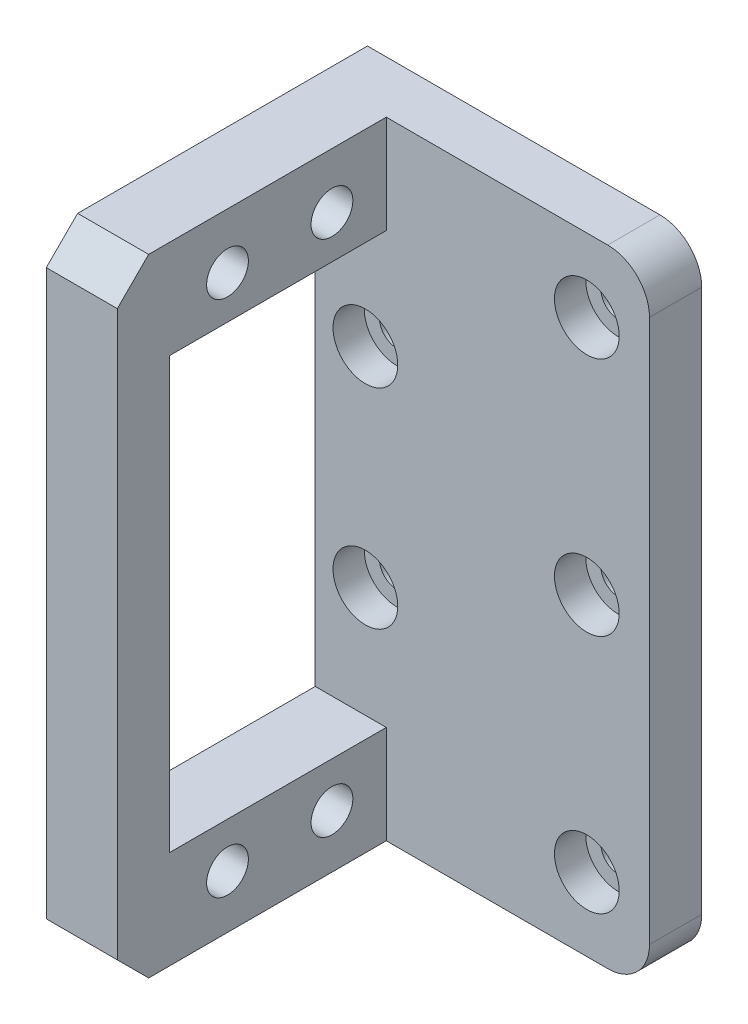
ISO-10303-21;
HEADER;
FILE_DESCRIPTION(('STEP AP214'),'2;1');
FILE_NAME('part.step','',(''),(''),'','','');
FILE_SCHEMA(('AUTOMOTIVE_DESIGN { 1 0 10303 214 1 1 1 1 }'));
ENDSEC;
DATA;
#1=APPLICATION_CONTEXT('core data for automotive mechanical design processes');
#2=APPLICATION_PROTOCOL_DEFINITION('international standard','automotive_design',2000,#1);
#3=PRODUCT_CONTEXT('',#1,'mechanical');
#4=PRODUCT('Part','Part','',(#3));
#5=PRODUCT_RELATED_PRODUCT_CATEGORY('part','',(#4));
#6=PRODUCT_DEFINITION_FORMATION('','',#4);
#7=PRODUCT_DEFINITION_CONTEXT('part definition',#1,'design');
#8=PRODUCT_DEFINITION('design','',#6,#7);
#9=PRODUCT_DEFINITION_SHAPE('','',#8);
#10=(LENGTH_UNIT() NAMED_UNIT(*) SI_UNIT(.MILLI.,.METRE.));
#11=(NAMED_UNIT(*) PLANE_ANGLE_UNIT() SI_UNIT($,.RADIAN.));
#12=(NAMED_UNIT(*) SI_UNIT($,.STERADIAN.) SOLID_ANGLE_UNIT());
#13=UNCERTAINTY_MEASURE_WITH_UNIT(LENGTH_MEASURE(1.E-05),#10,'distance_accuracy_value','');
#14=(GEOMETRIC_REPRESENTATION_CONTEXT(3) GLOBAL_UNCERTAINTY_ASSIGNED_CONTEXT((#13)) GLOBAL_UNIT_ASSIGNED_CONTEXT((#10,
#11,#12)) REPRESENTATION_CONTEXT('',''));
#15=CARTESIAN_POINT('',(0.,0.,0.));
#16=DIRECTION('',(0.,0.,1.));
#17=DIRECTION('',(1.,0.,0.));
#18=AXIS2_PLACEMENT_3D('',#15,#16,#17);
#19=CARTESIAN_POINT('',(-12.6999999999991,-19.9999999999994,-9.99999999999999));
#20=DIRECTION('',(0.,0.,1.));
#21=DIRECTION('',(1.,0.,0.));
#22=AXIS2_PLACEMENT_3D('',#19,#20,#21);
#23=CYLINDRICAL_SURFACE('',#22,1.65);
#24=CARTESIAN_POINT('',(-12.6999999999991,-19.9999999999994,0.));
#25=DIRECTION('',(0.,0.,-1.));
#26=DIRECTION('',(-1.,0.,0.));
#27=AXIS2_PLACEMENT_3D('',#24,#25,#26);
#28=CIRCLE('',#27,1.65);
#29=CARTESIAN_POINT('',(-14.3499999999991,-19.9999999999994,0.));
#30=VERTEX_POINT('',#29);
#31=EDGE_CURVE('E277',#30,#30,#28,.T.);
#32=ORIENTED_EDGE('',*,*,#31,.T.);
#33=EDGE_LOOP('',(#32));
#34=FACE_BOUND('',#33,.T.);
#35=CARTESIAN_POINT('',(-12.6999999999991,-19.9999999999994,2.));
#36=DIRECTION('',(0.,0.,1.));
#37=DIRECTION('',(1.,0.,0.));
#38=AXIS2_PLACEMENT_3D('',#35,#36,#37);
#39=CIRCLE('',#38,1.65);
#40=CARTESIAN_POINT('',(-11.0499999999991,-19.9999999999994,2.));
#41=VERTEX_POINT('',#40);
#42=EDGE_CURVE('E281',#41,#41,#39,.F.);
#43=ORIENTED_EDGE('',*,*,#42,.F.);
#44=EDGE_LOOP('',(#43));
#45=FACE_BOUND('',#44,.T.);
#46=ADVANCED_FACE('F35',(#34,#45),#23,.F.);
#47=CARTESIAN_POINT('',(8.49999999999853,-29.9999999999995,-9.99999999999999));
#48=DIRECTION('',(0.,0.,1.));
#49=DIRECTION('',(1.,0.,0.));
#50=AXIS2_PLACEMENT_3D('',#47,#48,#49);
#51=CYLINDRICAL_SURFACE('',#50,1.65);
#52=CARTESIAN_POINT('',(8.49999999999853,-29.9999999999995,0.));
#53=DIRECTION('',(0.,0.,-1.));
#54=DIRECTION('',(-1.,0.,0.));
#55=AXIS2_PLACEMENT_3D('',#52,#53,#54);
#56=CIRCLE('',#55,1.65);
#57=CARTESIAN_POINT('',(6.84999999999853,-29.9999999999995,0.));
#58=VERTEX_POINT('',#57);
#59=EDGE_CURVE('E280',#58,#58,#56,.T.);
#60=ORIENTED_EDGE('',*,*,#59,.T.);
#61=EDGE_LOOP('',(#60));
#62=FACE_BOUND('',#61,.T.);
#63=CARTESIAN_POINT('',(8.49999999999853,-29.9999999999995,2.));
#64=DIRECTION('',(0.,0.,1.));
#65=DIRECTION('',(1.,0.,0.));
#66=AXIS2_PLACEMENT_3D('',#63,#64,#65);
#67=CIRCLE('',#66,1.65);
#68=CARTESIAN_POINT('',(10.1499999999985,-29.9999999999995,2.));
#69=VERTEX_POINT('',#68);
#70=EDGE_CURVE('E318',#69,#69,#67,.F.);
#71=ORIENTED_EDGE('',*,*,#70,.F.);
#72=EDGE_LOOP('',(#71));
#73=FACE_BOUND('',#72,.T.);
#74=ADVANCED_FACE('F363',(#62,#73),#51,.F.);
#75=CARTESIAN_POINT('',(8.49999999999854,-52.9999999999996,-9.99999999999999));
#76=DIRECTION('',(0.,0.,1.));
#77=DIRECTION('',(1.,0.,0.));
#78=AXIS2_PLACEMENT_3D('',#75,#76,#77);
#79=CYLINDRICAL_SURFACE('',#78,1.65);
#80=CARTESIAN_POINT('',(8.49999999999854,-52.9999999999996,0.));
#81=DIRECTION('',(0.,0.,-1.));
#82=DIRECTION('',(-1.,0.,0.));
#83=AXIS2_PLACEMENT_3D('',#80,#81,#82);
#84=CIRCLE('',#83,1.65);
#85=CARTESIAN_POINT('',(6.84999999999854,-52.9999999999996,0.));
#86=VERTEX_POINT('',#85);
#87=EDGE_CURVE('E284',#86,#86,#84,.T.);
#88=ORIENTED_EDGE('',*,*,#87,.T.);
#89=EDGE_LOOP('',(#88));
#90=FACE_BOUND('',#89,.T.);
#91=CARTESIAN_POINT('',(8.49999999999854,-52.9999999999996,2.));
#92=DIRECTION('',(0.,0.,1.));
#93=DIRECTION('',(1.,0.,0.));
#94=AXIS2_PLACEMENT_3D('',#91,#92,#93);
#95=CIRCLE('',#94,1.65);
#96=CARTESIAN_POINT('',(10.1499999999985,-52.9999999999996,2.));
#97=VERTEX_POINT('',#96);
#98=EDGE_CURVE('E315',#97,#97,#95,.F.);
#99=ORIENTED_EDGE('',*,*,#98,.F.);
#100=EDGE_LOOP('',(#99));
#101=FACE_BOUND('',#100,.T.);
#102=ADVANCED_FACE('F369',(#90,#101),#79,.F.);
#103=CARTESIAN_POINT('',(8.49999999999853,-6.99999999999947,-9.99999999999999));
#104=DIRECTION('',(0.,0.,1.));
#105=DIRECTION('',(1.,0.,0.));
#106=AXIS2_PLACEMENT_3D('',#103,#104,#105);
#107=CYLINDRICAL_SURFACE('',#106,1.65);
#108=CARTESIAN_POINT('',(8.49999999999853,-6.99999999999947,0.));
#109=DIRECTION('',(0.,0.,-1.));
#110=DIRECTION('',(-1.,0.,0.));
#111=AXIS2_PLACEMENT_3D('',#108,#109,#110);
#112=CIRCLE('',#111,1.65);
#113=CARTESIAN_POINT('',(6.84999999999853,-6.99999999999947,0.));
#114=VERTEX_POINT('',#113);
#115=EDGE_CURVE('E287',#114,#114,#112,.T.);
#116=ORIENTED_EDGE('',*,*,#115,.T.);
#117=EDGE_LOOP('',(#116));
#118=FACE_BOUND('',#117,.T.);
#119=CARTESIAN_POINT('',(8.49999999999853,-6.99999999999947,2.));
#120=DIRECTION('',(0.,0.,1.));
#121=DIRECTION('',(1.,0.,0.));
#122=AXIS2_PLACEMENT_3D('',#119,#120,#121);
#123=CIRCLE('',#122,1.65);
#124=CARTESIAN_POINT('',(10.1499999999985,-6.99999999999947,2.));
#125=VERTEX_POINT('',#124);
#126=EDGE_CURVE('E312',#125,#125,#123,.F.);
#127=ORIENTED_EDGE('',*,*,#126,.F.);
#128=EDGE_LOOP('',(#127));
#129=FACE_BOUND('',#128,.T.);
#130=ADVANCED_FACE('F375',(#118,#129),#107,.F.);
#131=CARTESIAN_POINT('',(-12.6999999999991,-39.9999999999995,-9.99999999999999));
#132=DIRECTION('',(0.,0.,1.));
#133=DIRECTION('',(1.,0.,0.));
#134=AXIS2_PLACEMENT_3D('',#131,#132,#133);
#135=CYLINDRICAL_SURFACE('',#134,1.65);
#136=CARTESIAN_POINT('',(-12.6999999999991,-39.9999999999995,0.));
#137=DIRECTION('',(0.,0.,-1.));
#138=DIRECTION('',(-1.,0.,0.));
#139=AXIS2_PLACEMENT_3D('',#136,#137,#138);
#140=CIRCLE('',#139,1.65);
#141=CARTESIAN_POINT('',(-14.3499999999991,-39.9999999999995,0.));
#142=VERTEX_POINT('',#141);
#143=EDGE_CURVE('E223',#142,#142,#140,.T.);
#144=ORIENTED_EDGE('',*,*,#143,.T.);
#145=EDGE_LOOP('',(#144));
#146=FACE_BOUND('',#145,.T.);
#147=CARTESIAN_POINT('',(-12.6999999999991,-39.9999999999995,2.));
#148=DIRECTION('',(0.,0.,1.));
#149=DIRECTION('',(1.,0.,0.));
#150=AXIS2_PLACEMENT_3D('',#147,#148,#149);
#151=CIRCLE('',#150,1.65);
#152=CARTESIAN_POINT('',(-11.0499999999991,-39.9999999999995,2.));
#153=VERTEX_POINT('',#152);
#154=EDGE_CURVE('E203',#153,#153,#151,.F.);
#155=ORIENTED_EDGE('',*,*,#154,.F.);
#156=EDGE_LOOP('',(#155));
#157=FACE_BOUND('',#156,.T.);
#158=ADVANCED_FACE('F406',(#146,#157),#135,.F.);
#159=CARTESIAN_POINT('',(0.,0.,5.));
#160=DIRECTION('',(0.,0.,-1.));
#161=DIRECTION('',(-1.,0.,0.));
#162=AXIS2_PLACEMENT_3D('',#159,#160,#161);
#163=PLANE('',#162);
#164=CARTESIAN_POINT('',(8.49999999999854,-52.9999999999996,5.));
#165=DIRECTION('',(0.,0.,1.));
#166=DIRECTION('',(1.,0.,0.));
#167=AXIS2_PLACEMENT_3D('',#164,#165,#166);
#168=CIRCLE('',#167,3.1);
#169=CARTESIAN_POINT('',(11.5999999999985,-52.9999999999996,5.));
#170=VERTEX_POINT('',#169);
#171=EDGE_CURVE('E175',#170,#170,#168,.T.);
#172=ORIENTED_EDGE('',*,*,#171,.F.);
#173=EDGE_LOOP('',(#172));
#174=FACE_BOUND('',#173,.T.);
#175=CARTESIAN_POINT('',(-12.6999999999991,-39.9999999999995,5.));
#176=DIRECTION('',(0.,0.,1.));
#177=DIRECTION('',(1.,0.,0.));
#178=AXIS2_PLACEMENT_3D('',#175,#176,#177);
#179=CIRCLE('',#178,3.1);
#180=CARTESIAN_POINT('',(-9.59999999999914,-39.9999999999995,5.));
#181=VERTEX_POINT('',#180);
#182=EDGE_CURVE('E192',#181,#181,#179,.T.);
#183=ORIENTED_EDGE('',*,*,#182,.F.);
#184=EDGE_LOOP('',(#183));
#185=FACE_BOUND('',#184,.T.);
#186=CARTESIAN_POINT('',(8.49999999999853,-29.9999999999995,5.));
#187=DIRECTION('',(0.,0.,1.));
#188=DIRECTION('',(1.,0.,0.));
#189=AXIS2_PLACEMENT_3D('',#186,#187,#188);
#190=CIRCLE('',#189,3.1);
#191=CARTESIAN_POINT('',(11.5999999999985,-29.9999999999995,5.));
#192=VERTEX_POINT('',#191);
#193=EDGE_CURVE('E186',#192,#192,#190,.T.);
#194=ORIENTED_EDGE('',*,*,#193,.F.);
#195=EDGE_LOOP('',(#194));
#196=FACE_BOUND('',#195,.T.);
#197=CARTESIAN_POINT('',(8.49999999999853,-6.99999999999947,5.));
#198=DIRECTION('',(0.,0.,1.));
#199=DIRECTION('',(1.,0.,0.));
#200=AXIS2_PLACEMENT_3D('',#197,#198,#199);
#201=CIRCLE('',#200,3.1);
#202=CARTESIAN_POINT('',(11.5999999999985,-6.99999999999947,5.));
#203=VERTEX_POINT('',#202);
#204=EDGE_CURVE('E180',#203,#203,#201,.T.);
#205=ORIENTED_EDGE('',*,*,#204,.F.);
#206=EDGE_LOOP('',(#205));
#207=FACE_BOUND('',#206,.T.);
#208=CARTESIAN_POINT('',(-12.6999999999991,-19.9999999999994,5.));
#209=DIRECTION('',(0.,0.,1.));
#210=DIRECTION('',(1.,0.,0.));
#211=AXIS2_PLACEMENT_3D('',#208,#209,#210);
#212=CIRCLE('',#211,3.1);
#213=CARTESIAN_POINT('',(-9.59999999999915,-19.9999999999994,5.));
#214=VERTEX_POINT('',#213);
#215=EDGE_CURVE('E179',#214,#214,#212,.T.);
#216=ORIENTED_EDGE('',*,*,#215,.F.);
#217=EDGE_LOOP('',(#216));
#218=FACE_BOUND('',#217,.T.);
#219=DIRECTION('',(0.,1.,0.));
#220=VECTOR('',#219,1.);
#221=CARTESIAN_POINT('',(14.4999999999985,-59.9999999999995,5.));
#222=LINE('',#221,#220);
#223=CARTESIAN_POINT('',(14.4999999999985,-55.9999999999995,5.));
#224=VERTEX_POINT('',#223);
#225=CARTESIAN_POINT('',(14.4999999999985,-3.99999999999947,5.));
#226=VERTEX_POINT('',#225);
#227=EDGE_CURVE('E256',#224,#226,#222,.T.);
#228=ORIENTED_EDGE('',*,*,#227,.T.);
#229=CARTESIAN_POINT('',(10.4999999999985,-3.99999999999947,5.));
#230=DIRECTION('',(0.,0.,-1.));
#231=DIRECTION('',(-1.,0.,0.));
#232=AXIS2_PLACEMENT_3D('',#229,#230,#231);
#233=CIRCLE('',#232,4.);
#234=CARTESIAN_POINT('',(10.4999999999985,5.29307500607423E-13,5.));
#235=VERTEX_POINT('',#234);
#236=EDGE_CURVE('E305',#226,#235,#233,.F.);
#237=ORIENTED_EDGE('',*,*,#236,.T.);
#238=DIRECTION('',(-1.,0.,0.));
#239=VECTOR('',#238,1.);
#240=CARTESIAN_POINT('',(-17.5000000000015,5.42968447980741E-13,5.));
#241=LINE('',#240,#239);
#242=CARTESIAN_POINT('',(-10.7000000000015,5.39650789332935E-13,5.));
#243=VERTEX_POINT('',#242);
#244=EDGE_CURVE('E259',#235,#243,#241,.T.);
#245=ORIENTED_EDGE('',*,*,#244,.T.);
#246=DIRECTION('',(0.,1.,0.));
#247=VECTOR('',#246,1.);
#248=CARTESIAN_POINT('',(-10.7000000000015,0.,5.));
#249=LINE('',#248,#247);
#250=CARTESIAN_POINT('',(-10.7000000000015,-9.4,5.));
#251=VERTEX_POINT('',#250);
#252=EDGE_CURVE('E239',#251,#243,#249,.T.);
#253=ORIENTED_EDGE('',*,*,#252,.F.);
#254=DIRECTION('',(1.,0.,0.));
#255=VECTOR('',#254,1.);
#256=CARTESIAN_POINT('',(-17.5000000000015,-9.4,5.));
#257=LINE('',#256,#255);
#258=CARTESIAN_POINT('',(-17.5000000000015,-9.4,5.));
#259=VERTEX_POINT('',#258);
#260=EDGE_CURVE('E236',#259,#251,#257,.T.);
#261=ORIENTED_EDGE('',*,*,#260,.F.);
#262=DIRECTION('',(0.,-1.,0.));
#263=VECTOR('',#262,1.);
#264=CARTESIAN_POINT('',(-17.5000000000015,-59.9999999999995,5.));
#265=LINE('',#264,#263);
#266=CARTESIAN_POINT('',(-17.5000000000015,-50.5999999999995,5.));
#267=VERTEX_POINT('',#266);
#268=EDGE_CURVE('E250',#259,#267,#265,.T.);
#269=ORIENTED_EDGE('',*,*,#268,.T.);
#270=DIRECTION('',(-1.,0.,0.));
#271=VECTOR('',#270,1.);
#272=CARTESIAN_POINT('',(-17.5000000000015,-50.5999999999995,5.));
#273=LINE('',#272,#271);
#274=CARTESIAN_POINT('',(-10.7000000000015,-50.5999999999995,5.));
#275=VERTEX_POINT('',#274);
#276=EDGE_CURVE('E232',#275,#267,#273,.T.);
#277=ORIENTED_EDGE('',*,*,#276,.F.);
#278=DIRECTION('',(0.,1.,0.));
#279=VECTOR('',#278,1.);
#280=CARTESIAN_POINT('',(-10.7000000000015,-59.9999999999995,5.));
#281=LINE('',#280,#279);
#282=CARTESIAN_POINT('',(-10.7000000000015,-59.9999999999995,5.));
#283=VERTEX_POINT('',#282);
#284=EDGE_CURVE('E159',#283,#275,#281,.T.);
#285=ORIENTED_EDGE('',*,*,#284,.F.);
#286=DIRECTION('',(1.,0.,0.));
#287=VECTOR('',#286,1.);
#288=CARTESIAN_POINT('',(-17.5000000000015,-59.9999999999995,5.));
#289=LINE('',#288,#287);
#290=CARTESIAN_POINT('',(10.4999999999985,-59.9999999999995,5.));
#291=VERTEX_POINT('',#290);
#292=EDGE_CURVE('E252',#283,#291,#289,.T.);
#293=ORIENTED_EDGE('',*,*,#292,.T.);
#294=CARTESIAN_POINT('',(10.4999999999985,-55.9999999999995,5.));
#295=DIRECTION('',(0.,0.,-1.));
#296=DIRECTION('',(-1.,0.,0.));
#297=AXIS2_PLACEMENT_3D('',#294,#295,#296);
#298=CIRCLE('',#297,4.);
#299=EDGE_CURVE('E303',#291,#224,#298,.F.);
#300=ORIENTED_EDGE('',*,*,#299,.T.);
#301=EDGE_LOOP('',(#228,#237,#245,#253,#261,#269,#277,#285,#293,#300));
#302=FACE_BOUND('',#301,.T.);
#303=ADVANCED_FACE('F403',(#174,#185,#196,#207,#218,#302),#163,.F.);
#304=CARTESIAN_POINT('',(-17.5000000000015,-59.9999999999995,5.));
#305=DIRECTION('',(1.,0.,0.));
#306=DIRECTION('',(0.,0.,-1.));
#307=AXIS2_PLACEMENT_3D('',#304,#305,#306);
#308=PLANE('',#307);
#309=DIRECTION('',(0.,0.,-1.));
#310=VECTOR('',#309,1.);
#311=CARTESIAN_POINT('',(-17.5000000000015,-9.4,36.1517240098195));
#312=LINE('',#311,#310);
#313=CARTESIAN_POINT('',(-17.5000000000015,-9.4,25.7500000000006));
#314=VERTEX_POINT('',#313);
#315=EDGE_CURVE('E246',#314,#259,#312,.T.);
#316=ORIENTED_EDGE('',*,*,#315,.F.);
#317=DIRECTION('',(0.,-1.,0.));
#318=VECTOR('',#317,1.);
#319=CARTESIAN_POINT('',(-17.5000000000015,-59.9999999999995,25.7500000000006));
#320=LINE('',#319,#318);
#321=CARTESIAN_POINT('',(-17.5000000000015,-50.5999999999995,25.7500000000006));
#322=VERTEX_POINT('',#321);
#323=EDGE_CURVE('E170',#314,#322,#320,.T.);
#324=ORIENTED_EDGE('',*,*,#323,.T.);
#325=DIRECTION('',(0.,0.,-1.));
#326=VECTOR('',#325,1.);
#327=CARTESIAN_POINT('',(-17.5000000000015,-50.5999999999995,36.1517240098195));
#328=LINE('',#327,#326);
#329=EDGE_CURVE('E146',#322,#267,#328,.T.);
#330=ORIENTED_EDGE('',*,*,#329,.T.);
#331=ORIENTED_EDGE('',*,*,#268,.F.);
#332=EDGE_LOOP('',(#316,#324,#330,#331));
#333=FACE_BOUND('',#332,.T.);
#334=CARTESIAN_POINT('',(-17.5000000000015,-5.30000000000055,10.2000000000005));
#335=DIRECTION('',(-1.,0.,0.));
#336=DIRECTION('',(0.,0.,1.));
#337=AXIS2_PLACEMENT_3D('',#334,#335,#336);
#338=CIRCLE('',#337,2.);
#339=CARTESIAN_POINT('',(-17.5000000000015,-5.30000000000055,12.2000000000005));
#340=VERTEX_POINT('',#339);
#341=EDGE_CURVE('E220',#340,#340,#338,.T.);
#342=ORIENTED_EDGE('',*,*,#341,.F.);
#343=EDGE_LOOP('',(#342));
#344=FACE_BOUND('',#343,.T.);
#345=CARTESIAN_POINT('',(-17.5000000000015,-5.30000000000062,20.2000000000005));
#346=DIRECTION('',(-1.,0.,0.));
#347=DIRECTION('',(0.,0.,1.));
#348=AXIS2_PLACEMENT_3D('',#345,#346,#347);
#349=CIRCLE('',#348,2.);
#350=CARTESIAN_POINT('',(-17.5000000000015,-5.30000000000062,22.2000000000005));
#351=VERTEX_POINT('',#350);
#352=EDGE_CURVE('E214',#351,#351,#349,.T.);
#353=ORIENTED_EDGE('',*,*,#352,.F.);
#354=EDGE_LOOP('',(#353));
#355=FACE_BOUND('',#354,.T.);
#356=CARTESIAN_POINT('',(-17.5000000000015,-54.9000000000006,20.2000000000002));
#357=DIRECTION('',(-1.,0.,0.));
#358=DIRECTION('',(0.,0.,1.));
#359=AXIS2_PLACEMENT_3D('',#356,#357,#358);
#360=CIRCLE('',#359,2.);
#361=CARTESIAN_POINT('',(-17.5000000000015,-54.9000000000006,22.2000000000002));
#362=VERTEX_POINT('',#361);
#363=EDGE_CURVE('E206',#362,#362,#360,.T.);
#364=ORIENTED_EDGE('',*,*,#363,.F.);
#365=EDGE_LOOP('',(#364));
#366=FACE_BOUND('',#365,.T.);
#367=CARTESIAN_POINT('',(-17.5000000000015,-54.9000000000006,10.2000000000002));
#368=DIRECTION('',(-1.,0.,0.));
#369=DIRECTION('',(0.,0.,1.));
#370=AXIS2_PLACEMENT_3D('',#367,#368,#369);
#371=CIRCLE('',#370,2.);
#372=CARTESIAN_POINT('',(-17.5000000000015,-54.9000000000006,12.2000000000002));
#373=VERTEX_POINT('',#372);
#374=EDGE_CURVE('E213',#373,#373,#371,.T.);
#375=ORIENTED_EDGE('',*,*,#374,.F.);
#376=EDGE_LOOP('',(#375));
#377=FACE_BOUND('',#376,.T.);
#378=DIRECTION('',(0.,1.,0.));
#379=VECTOR('',#378,1.);
#380=CARTESIAN_POINT('',(-17.5000000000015,-59.9999999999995,30.7500000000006));
#381=LINE('',#380,#379);
#382=CARTESIAN_POINT('',(-17.5000000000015,-56.9999999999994,30.7500000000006));
#383=VERTEX_POINT('',#382);
#384=CARTESIAN_POINT('',(-17.5000000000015,-2.99999999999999,30.7500000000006));
#385=VERTEX_POINT('',#384);
#386=EDGE_CURVE('E167',#383,#385,#381,.T.);
#387=ORIENTED_EDGE('',*,*,#386,.T.);
#388=DIRECTION('',(0.,0.707106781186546,-0.707106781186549));
#389=VECTOR('',#388,1.);
#390=CARTESIAN_POINT('',(-17.5000000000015,-3.00000000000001,30.7500000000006));
#391=LINE('',#390,#389);
#392=CARTESIAN_POINT('',(-17.5000000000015,5.42968447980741E-13,27.75));
#393=VERTEX_POINT('',#392);
#394=EDGE_CURVE('E329',#385,#393,#391,.T.);
#395=ORIENTED_EDGE('',*,*,#394,.T.);
#396=DIRECTION('',(0.,0.,-1.));
#397=VECTOR('',#396,1.);
#398=CARTESIAN_POINT('',(-17.5000000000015,5.42968447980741E-13,5.));
#399=LINE('',#398,#397);
#400=CARTESIAN_POINT('',(-17.5000000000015,5.42968447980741E-13,0.));
#401=VERTEX_POINT('',#400);
#402=EDGE_CURVE('E262',#393,#401,#399,.T.);
#403=ORIENTED_EDGE('',*,*,#402,.T.);
#404=DIRECTION('',(0.,-1.,0.));
#405=VECTOR('',#404,1.);
#406=CARTESIAN_POINT('',(-17.5000000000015,-59.9999999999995,0.));
#407=LINE('',#406,#405);
#408=CARTESIAN_POINT('',(-17.5000000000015,-59.9999999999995,0.));
#409=VERTEX_POINT('',#408);
#410=EDGE_CURVE('E249',#401,#409,#407,.T.);
#411=ORIENTED_EDGE('',*,*,#410,.T.);
#412=DIRECTION('',(0.,0.,-1.));
#413=VECTOR('',#412,1.);
#414=CARTESIAN_POINT('',(-17.5000000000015,-59.9999999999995,5.));
#415=LINE('',#414,#413);
#416=CARTESIAN_POINT('',(-17.5000000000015,-59.9999999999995,27.7500000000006));
#417=VERTEX_POINT('',#416);
#418=EDGE_CURVE('E274',#417,#409,#415,.T.);
#419=ORIENTED_EDGE('',*,*,#418,.F.);
#420=DIRECTION('',(0.,0.707106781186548,0.707106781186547));
#421=VECTOR('',#420,1.);
#422=CARTESIAN_POINT('',(-17.5000000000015,-59.9999999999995,27.7500000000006));
#423=LINE('',#422,#421);
#424=EDGE_CURVE('E327',#417,#383,#423,.T.);
#425=ORIENTED_EDGE('',*,*,#424,.T.);
#426=EDGE_LOOP('',(#387,#395,#403,#411,#419,#425));
#427=FACE_BOUND('',#426,.T.);
#428=ADVANCED_FACE('F342',(#333,#344,#355,#366,#377,#427),#308,.F.);
#429=CARTESIAN_POINT('',(-17.5000000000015,-59.9999999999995,5.));
#430=DIRECTION('',(0.,1.,0.));
#431=DIRECTION('',(-1.,0.,0.));
#432=AXIS2_PLACEMENT_3D('',#429,#430,#431);
#433=PLANE('',#432);
#434=DIRECTION('',(0.,0.,-1.));
#435=VECTOR('',#434,1.);
#436=CARTESIAN_POINT('',(-10.7000000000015,-59.9999999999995,36.1517240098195));
#437=LINE('',#436,#435);
#438=CARTESIAN_POINT('',(-10.7000000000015,-59.9999999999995,27.7500000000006));
#439=VERTEX_POINT('',#438);
#440=EDGE_CURVE('E160',#439,#283,#437,.T.);
#441=ORIENTED_EDGE('',*,*,#440,.F.);
#442=DIRECTION('',(-1.,0.,0.));
#443=VECTOR('',#442,1.);
#444=CARTESIAN_POINT('',(-17.5000000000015,-59.9999999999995,27.7500000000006));
#445=LINE('',#444,#443);
#446=EDGE_CURVE('E11',#439,#417,#445,.T.);
#447=ORIENTED_EDGE('',*,*,#446,.T.);
#448=ORIENTED_EDGE('',*,*,#418,.T.);
#449=DIRECTION('',(1.,0.,0.));
#450=VECTOR('',#449,1.);
#451=CARTESIAN_POINT('',(-17.5000000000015,-59.9999999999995,0.));
#452=LINE('',#451,#450);
#453=CARTESIAN_POINT('',(10.4999999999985,-59.9999999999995,0.));
#454=VERTEX_POINT('',#453);
#455=EDGE_CURVE('E265',#409,#454,#452,.T.);
#456=ORIENTED_EDGE('',*,*,#455,.T.);
#457=DIRECTION('',(0.,0.,-1.));
#458=VECTOR('',#457,1.);
#459=CARTESIAN_POINT('',(10.4999999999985,-59.9999999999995,5.));
#460=LINE('',#459,#458);
#461=EDGE_CURVE('E307',#454,#291,#460,.F.);
#462=ORIENTED_EDGE('',*,*,#461,.T.);
#463=ORIENTED_EDGE('',*,*,#292,.F.);
#464=EDGE_LOOP('',(#441,#447,#448,#456,#462,#463));
#465=FACE_BOUND('',#464,.T.);
#466=ADVANCED_FACE('F353',(#465),#433,.F.);
#467=CARTESIAN_POINT('',(14.4999999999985,-59.9999999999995,5.));
#468=DIRECTION('',(-1.,0.,0.));
#469=DIRECTION('',(0.,0.,1.));
#470=AXIS2_PLACEMENT_3D('',#467,#468,#469);
#471=PLANE('',#470);
#472=DIRECTION('',(0.,1.,0.));
#473=VECTOR('',#472,1.);
#474=CARTESIAN_POINT('',(14.4999999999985,-59.9999999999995,0.));
#475=LINE('',#474,#473);
#476=CARTESIAN_POINT('',(14.4999999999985,-55.9999999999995,0.));
#477=VERTEX_POINT('',#476);
#478=CARTESIAN_POINT('',(14.4999999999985,-3.99999999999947,0.));
#479=VERTEX_POINT('',#478);
#480=EDGE_CURVE('E268',#477,#479,#475,.T.);
#481=ORIENTED_EDGE('',*,*,#480,.T.);
#482=DIRECTION('',(0.,0.,-1.));
#483=VECTOR('',#482,1.);
#484=CARTESIAN_POINT('',(14.4999999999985,-3.99999999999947,5.));
#485=LINE('',#484,#483);
#486=EDGE_CURVE('E301',#479,#226,#485,.F.);
#487=ORIENTED_EDGE('',*,*,#486,.T.);
#488=ORIENTED_EDGE('',*,*,#227,.F.);
#489=DIRECTION('',(0.,0.,-1.));
#490=VECTOR('',#489,1.);
#491=CARTESIAN_POINT('',(14.4999999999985,-55.9999999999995,5.));
#492=LINE('',#491,#490);
#493=EDGE_CURVE('E298',#224,#477,#492,.T.);
#494=ORIENTED_EDGE('',*,*,#493,.T.);
#495=EDGE_LOOP('',(#481,#487,#488,#494));
#496=FACE_BOUND('',#495,.T.);
#497=ADVANCED_FACE('F413',(#496),#471,.F.);
#498=CARTESIAN_POINT('',(-17.5000000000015,5.42968447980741E-13,5.));
#499=DIRECTION('',(0.,-1.,0.));
#500=DIRECTION('',(1.,0.,0.));
#501=AXIS2_PLACEMENT_3D('',#498,#499,#500);
#502=PLANE('',#501);
#503=ORIENTED_EDGE('',*,*,#402,.F.);
#504=DIRECTION('',(1.,0.,0.));
#505=VECTOR('',#504,1.);
#506=CARTESIAN_POINT('',(-10.7000000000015,5.39650789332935E-13,27.75));
#507=LINE('',#506,#505);
#508=CARTESIAN_POINT('',(-10.7000000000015,0.,27.75));
#509=VERTEX_POINT('',#508);
#510=EDGE_CURVE('E59',#393,#509,#507,.T.);
#511=ORIENTED_EDGE('',*,*,#510,.T.);
#512=DIRECTION('',(0.,0.,-1.));
#513=VECTOR('',#512,1.);
#514=CARTESIAN_POINT('',(-10.7000000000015,0.,36.1517240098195));
#515=LINE('',#514,#513);
#516=EDGE_CURVE('E242',#509,#243,#515,.T.);
#517=ORIENTED_EDGE('',*,*,#516,.T.);
#518=ORIENTED_EDGE('',*,*,#244,.F.);
#519=DIRECTION('',(0.,0.,-1.));
#520=VECTOR('',#519,1.);
#521=CARTESIAN_POINT('',(10.4999999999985,5.29307500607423E-13,5.));
#522=LINE('',#521,#520);
#523=CARTESIAN_POINT('',(10.4999999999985,5.29307500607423E-13,0.));
#524=VERTEX_POINT('',#523);
#525=EDGE_CURVE('E276',#235,#524,#522,.T.);
#526=ORIENTED_EDGE('',*,*,#525,.T.);
#527=DIRECTION('',(-1.,0.,0.));
#528=VECTOR('',#527,1.);
#529=CARTESIAN_POINT('',(-17.5000000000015,5.42968447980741E-13,0.));
#530=LINE('',#529,#528);
#531=EDGE_CURVE('E253',#524,#401,#530,.T.);
#532=ORIENTED_EDGE('',*,*,#531,.T.);
#533=EDGE_LOOP('',(#503,#511,#517,#518,#526,#532));
#534=FACE_BOUND('',#533,.T.);
#535=ADVANCED_FACE('F343',(#534),#502,.F.);
#536=CARTESIAN_POINT('',(0.,0.,0.));
#537=DIRECTION('',(0.,0.,-1.));
#538=DIRECTION('',(-1.,0.,0.));
#539=AXIS2_PLACEMENT_3D('',#536,#537,#538);
#540=PLANE('',#539);
#541=ORIENTED_EDGE('',*,*,#143,.F.);
#542=EDGE_LOOP('',(#541));
#543=FACE_BOUND('',#542,.T.);
#544=ORIENTED_EDGE('',*,*,#115,.F.);
#545=EDGE_LOOP('',(#544));
#546=FACE_BOUND('',#545,.T.);
#547=ORIENTED_EDGE('',*,*,#87,.F.);
#548=EDGE_LOOP('',(#547));
#549=FACE_BOUND('',#548,.T.);
#550=ORIENTED_EDGE('',*,*,#59,.F.);
#551=EDGE_LOOP('',(#550));
#552=FACE_BOUND('',#551,.T.);
#553=ORIENTED_EDGE('',*,*,#31,.F.);
#554=EDGE_LOOP('',(#553));
#555=FACE_BOUND('',#554,.T.);
#556=ORIENTED_EDGE('',*,*,#531,.F.);
#557=CARTESIAN_POINT('',(10.4999999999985,-3.99999999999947,0.));
#558=DIRECTION('',(0.,0.,-1.));
#559=DIRECTION('',(-1.,0.,0.));
#560=AXIS2_PLACEMENT_3D('',#557,#558,#559);
#561=CIRCLE('',#560,4.);
#562=EDGE_CURVE('E296',#524,#479,#561,.T.);
#563=ORIENTED_EDGE('',*,*,#562,.T.);
#564=ORIENTED_EDGE('',*,*,#480,.F.);
#565=CARTESIAN_POINT('',(10.4999999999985,-55.9999999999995,0.));
#566=DIRECTION('',(0.,0.,-1.));
#567=DIRECTION('',(-1.,0.,0.));
#568=AXIS2_PLACEMENT_3D('',#565,#566,#567);
#569=CIRCLE('',#568,4.);
#570=EDGE_CURVE('E294',#477,#454,#569,.T.);
#571=ORIENTED_EDGE('',*,*,#570,.T.);
#572=ORIENTED_EDGE('',*,*,#455,.F.);
#573=ORIENTED_EDGE('',*,*,#410,.F.);
#574=EDGE_LOOP('',(#556,#563,#564,#571,#572,#573));
#575=FACE_BOUND('',#574,.T.);
#576=ADVANCED_FACE('F350',(#543,#546,#549,#552,#555,#575),#540,.T.);
#577=CARTESIAN_POINT('',(-10.7000000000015,0.,36.1517240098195));
#578=DIRECTION('',(-1.,0.,0.));
#579=DIRECTION('',(0.,-1.,0.));
#580=AXIS2_PLACEMENT_3D('',#577,#578,#579);
#581=PLANE('',#580);
#582=CARTESIAN_POINT('',(-10.7000000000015,-5.30000000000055,10.2000000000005));
#583=DIRECTION('',(-1.,0.,0.));
#584=DIRECTION('',(0.,0.,1.));
#585=AXIS2_PLACEMENT_3D('',#582,#583,#584);
#586=CIRCLE('',#585,2.);
#587=CARTESIAN_POINT('',(-10.7000000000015,-5.30000000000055,12.2000000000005));
#588=VERTEX_POINT('',#587);
#589=EDGE_CURVE('E217',#588,#588,#586,.F.);
#590=ORIENTED_EDGE('',*,*,#589,.F.);
#591=EDGE_LOOP('',(#590));
#592=FACE_BOUND('',#591,.T.);
#593=CARTESIAN_POINT('',(-10.7000000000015,-5.30000000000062,20.2000000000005));
#594=DIRECTION('',(-1.,0.,0.));
#595=DIRECTION('',(0.,0.,1.));
#596=AXIS2_PLACEMENT_3D('',#593,#594,#595);
#597=CIRCLE('',#596,2.);
#598=CARTESIAN_POINT('',(-10.7000000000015,-5.30000000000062,22.2000000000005));
#599=VERTEX_POINT('',#598);
#600=EDGE_CURVE('E210',#599,#599,#597,.F.);
#601=ORIENTED_EDGE('',*,*,#600,.F.);
#602=EDGE_LOOP('',(#601));
#603=FACE_BOUND('',#602,.T.);
#604=ORIENTED_EDGE('',*,*,#516,.F.);
#605=DIRECTION('',(0.,-0.707106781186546,0.707106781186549));
#606=VECTOR('',#605,1.);
#607=CARTESIAN_POINT('',(-10.7000000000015,-3.00000000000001,30.7500000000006));
#608=LINE('',#607,#606);
#609=CARTESIAN_POINT('',(-10.7000000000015,-3.,30.7500000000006));
#610=VERTEX_POINT('',#609);
#611=EDGE_CURVE('E44',#509,#610,#608,.T.);
#612=ORIENTED_EDGE('',*,*,#611,.T.);
#613=DIRECTION('',(0.,-1.,0.));
#614=VECTOR('',#613,1.);
#615=CARTESIAN_POINT('',(-10.7000000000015,-59.9999999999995,30.7500000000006));
#616=LINE('',#615,#614);
#617=CARTESIAN_POINT('',(-10.7000000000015,-56.9999999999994,30.7500000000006));
#618=VERTEX_POINT('',#617);
#619=EDGE_CURVE('E165',#610,#618,#616,.T.);
#620=ORIENTED_EDGE('',*,*,#619,.T.);
#621=DIRECTION('',(0.,-0.707106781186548,-0.707106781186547));
#622=VECTOR('',#621,1.);
#623=CARTESIAN_POINT('',(-10.7000000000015,-59.9999999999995,27.7500000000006));
#624=LINE('',#623,#622);
#625=EDGE_CURVE('E51',#618,#439,#624,.T.);
#626=ORIENTED_EDGE('',*,*,#625,.T.);
#627=ORIENTED_EDGE('',*,*,#440,.T.);
#628=ORIENTED_EDGE('',*,*,#284,.T.);
#629=DIRECTION('',(0.,0.,-1.));
#630=VECTOR('',#629,1.);
#631=CARTESIAN_POINT('',(-10.7000000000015,-50.5999999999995,36.1517240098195));
#632=LINE('',#631,#630);
#633=CARTESIAN_POINT('',(-10.7000000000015,-50.5999999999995,25.7500000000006));
#634=VERTEX_POINT('',#633);
#635=EDGE_CURVE('E143',#634,#275,#632,.T.);
#636=ORIENTED_EDGE('',*,*,#635,.F.);
#637=DIRECTION('',(0.,1.,0.));
#638=VECTOR('',#637,1.);
#639=CARTESIAN_POINT('',(-10.7000000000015,-59.9999999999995,25.7500000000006));
#640=LINE('',#639,#638);
#641=CARTESIAN_POINT('',(-10.7000000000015,-9.4,25.7500000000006));
#642=VERTEX_POINT('',#641);
#643=EDGE_CURVE('E152',#634,#642,#640,.T.);
#644=ORIENTED_EDGE('',*,*,#643,.T.);
#645=DIRECTION('',(0.,0.,-1.));
#646=VECTOR('',#645,1.);
#647=CARTESIAN_POINT('',(-10.7000000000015,-9.4,36.1517240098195));
#648=LINE('',#647,#646);
#649=EDGE_CURVE('E244',#642,#251,#648,.T.);
#650=ORIENTED_EDGE('',*,*,#649,.T.);
#651=ORIENTED_EDGE('',*,*,#252,.T.);
#652=EDGE_LOOP('',(#604,#612,#620,#626,#627,#628,#636,#644,#650,#651));
#653=FACE_BOUND('',#652,.T.);
#654=CARTESIAN_POINT('',(-10.7000000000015,-54.9000000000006,20.2000000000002));
#655=DIRECTION('',(-1.,0.,0.));
#656=DIRECTION('',(0.,0.,1.));
#657=AXIS2_PLACEMENT_3D('',#654,#655,#656);
#658=CIRCLE('',#657,2.);
#659=CARTESIAN_POINT('',(-10.7000000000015,-54.9000000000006,22.2000000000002));
#660=VERTEX_POINT('',#659);
#661=EDGE_CURVE('E209',#660,#660,#658,.F.);
#662=ORIENTED_EDGE('',*,*,#661,.F.);
#663=EDGE_LOOP('',(#662));
#664=FACE_BOUND('',#663,.T.);
#665=CARTESIAN_POINT('',(-10.7000000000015,-54.9000000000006,10.2000000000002));
#666=DIRECTION('',(-1.,0.,0.));
#667=DIRECTION('',(0.,0.,1.));
#668=AXIS2_PLACEMENT_3D('',#665,#666,#667);
#669=CIRCLE('',#668,2.);
#670=CARTESIAN_POINT('',(-10.7000000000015,-54.9000000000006,12.2000000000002));
#671=VERTEX_POINT('',#670);
#672=EDGE_CURVE('E228',#671,#671,#669,.F.);
#673=ORIENTED_EDGE('',*,*,#672,.F.);
#674=EDGE_LOOP('',(#673));
#675=FACE_BOUND('',#674,.T.);
#676=ADVANCED_FACE('F155',(#592,#603,#653,#664,#675),#581,.F.);
#677=CARTESIAN_POINT('',(-17.5000000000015,-9.4,36.1517240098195));
#678=DIRECTION('',(0.,1.,0.));
#679=DIRECTION('',(0.,0.,1.));
#680=AXIS2_PLACEMENT_3D('',#677,#678,#679);
#681=PLANE('',#680);
#682=ORIENTED_EDGE('',*,*,#649,.F.);
#683=DIRECTION('',(1.,0.,0.));
#684=VECTOR('',#683,1.);
#685=CARTESIAN_POINT('',(-17.5000000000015,-9.4,25.7500000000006));
#686=LINE('',#685,#684);
#687=EDGE_CURVE('E151',#314,#642,#686,.T.);
#688=ORIENTED_EDGE('',*,*,#687,.F.);
#689=ORIENTED_EDGE('',*,*,#315,.T.);
#690=ORIENTED_EDGE('',*,*,#260,.T.);
#691=EDGE_LOOP('',(#682,#688,#689,#690));
#692=FACE_BOUND('',#691,.T.);
#693=ADVANCED_FACE('F396',(#692),#681,.F.);
#694=CARTESIAN_POINT('',(-17.5000000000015,-50.5999999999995,36.1517240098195));
#695=DIRECTION('',(0.,-1.,0.));
#696=DIRECTION('',(0.,0.,-1.));
#697=AXIS2_PLACEMENT_3D('',#694,#695,#696);
#698=PLANE('',#697);
#699=ORIENTED_EDGE('',*,*,#329,.F.);
#700=DIRECTION('',(-1.,0.,0.));
#701=VECTOR('',#700,1.);
#702=CARTESIAN_POINT('',(-10.7000000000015,-50.5999999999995,25.7500000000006));
#703=LINE('',#702,#701);
#704=EDGE_CURVE('E139',#634,#322,#703,.T.);
#705=ORIENTED_EDGE('',*,*,#704,.F.);
#706=ORIENTED_EDGE('',*,*,#635,.T.);
#707=ORIENTED_EDGE('',*,*,#276,.T.);
#708=EDGE_LOOP('',(#699,#705,#706,#707));
#709=FACE_BOUND('',#708,.T.);
#710=ADVANCED_FACE('F141',(#709),#698,.F.);
#711=CARTESIAN_POINT('',(-5.04314575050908,-54.9000000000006,10.2000000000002));
#712=DIRECTION('',(-1.,0.,0.));
#713=DIRECTION('',(0.,0.,1.));
#714=AXIS2_PLACEMENT_3D('',#711,#712,#713);
#715=CYLINDRICAL_SURFACE('',#714,2.);
#716=ORIENTED_EDGE('',*,*,#672,.T.);
#717=EDGE_LOOP('',(#716));
#718=FACE_BOUND('',#717,.T.);
#719=ORIENTED_EDGE('',*,*,#374,.T.);
#720=EDGE_LOOP('',(#719));
#721=FACE_BOUND('',#720,.T.);
#722=ADVANCED_FACE('F381',(#718,#721),#715,.F.);
#723=CARTESIAN_POINT('',(-5.04314575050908,-54.9000000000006,20.2000000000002));
#724=DIRECTION('',(-1.,0.,0.));
#725=DIRECTION('',(0.,0.,1.));
#726=AXIS2_PLACEMENT_3D('',#723,#724,#725);
#727=CYLINDRICAL_SURFACE('',#726,2.);
#728=ORIENTED_EDGE('',*,*,#661,.T.);
#729=EDGE_LOOP('',(#728));
#730=FACE_BOUND('',#729,.T.);
#731=ORIENTED_EDGE('',*,*,#363,.T.);
#732=EDGE_LOOP('',(#731));
#733=FACE_BOUND('',#732,.T.);
#734=ADVANCED_FACE('F377',(#730,#733),#727,.F.);
#735=CARTESIAN_POINT('',(-5.04314575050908,-5.30000000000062,20.2000000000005));
#736=DIRECTION('',(-1.,0.,0.));
#737=DIRECTION('',(0.,0.,1.));
#738=AXIS2_PLACEMENT_3D('',#735,#736,#737);
#739=CYLINDRICAL_SURFACE('',#738,2.);
#740=ORIENTED_EDGE('',*,*,#600,.T.);
#741=EDGE_LOOP('',(#740));
#742=FACE_BOUND('',#741,.T.);
#743=ORIENTED_EDGE('',*,*,#352,.T.);
#744=EDGE_LOOP('',(#743));
#745=FACE_BOUND('',#744,.T.);
#746=ADVANCED_FACE('F380',(#742,#745),#739,.F.);
#747=CARTESIAN_POINT('',(-5.04314575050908,-5.30000000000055,10.2000000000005));
#748=DIRECTION('',(-1.,0.,0.));
#749=DIRECTION('',(0.,0.,1.));
#750=AXIS2_PLACEMENT_3D('',#747,#748,#749);
#751=CYLINDRICAL_SURFACE('',#750,2.);
#752=ORIENTED_EDGE('',*,*,#589,.T.);
#753=EDGE_LOOP('',(#752));
#754=FACE_BOUND('',#753,.T.);
#755=ORIENTED_EDGE('',*,*,#341,.T.);
#756=EDGE_LOOP('',(#755));
#757=FACE_BOUND('',#756,.T.);
#758=ADVANCED_FACE('F385',(#754,#757),#751,.F.);
#759=CARTESIAN_POINT('',(10.4999999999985,-3.99999999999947,5.));
#760=DIRECTION('',(0.,0.,-1.));
#761=DIRECTION('',(-1.,0.,0.));
#762=AXIS2_PLACEMENT_3D('',#759,#760,#761);
#763=CYLINDRICAL_SURFACE('',#762,4.);
#764=ORIENTED_EDGE('',*,*,#236,.F.);
#765=ORIENTED_EDGE('',*,*,#486,.F.);
#766=ORIENTED_EDGE('',*,*,#562,.F.);
#767=ORIENTED_EDGE('',*,*,#525,.F.);
#768=EDGE_LOOP('',(#764,#765,#766,#767));
#769=FACE_BOUND('',#768,.T.);
#770=ADVANCED_FACE('F389',(#769),#763,.T.);
#771=CARTESIAN_POINT('',(10.4999999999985,-55.9999999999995,5.));
#772=DIRECTION('',(0.,0.,-1.));
#773=DIRECTION('',(-1.,0.,0.));
#774=AXIS2_PLACEMENT_3D('',#771,#772,#773);
#775=CYLINDRICAL_SURFACE('',#774,4.);
#776=ORIENTED_EDGE('',*,*,#299,.F.);
#777=ORIENTED_EDGE('',*,*,#461,.F.);
#778=ORIENTED_EDGE('',*,*,#570,.F.);
#779=ORIENTED_EDGE('',*,*,#493,.F.);
#780=EDGE_LOOP('',(#776,#777,#778,#779));
#781=FACE_BOUND('',#780,.T.);
#782=ADVANCED_FACE('F424',(#781),#775,.T.);
#783=CARTESIAN_POINT('',(-12.6999999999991,-39.9999999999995,2.));
#784=DIRECTION('',(0.,0.,1.));
#785=DIRECTION('',(1.,0.,0.));
#786=AXIS2_PLACEMENT_3D('',#783,#784,#785);
#787=PLANE('',#786);
#788=CARTESIAN_POINT('',(-12.6999999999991,-39.9999999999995,2.));
#789=DIRECTION('',(0.,0.,1.));
#790=DIRECTION('',(1.,0.,0.));
#791=AXIS2_PLACEMENT_3D('',#788,#789,#790);
#792=CIRCLE('',#791,3.1);
#793=CARTESIAN_POINT('',(-9.59999999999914,-39.9999999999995,2.));
#794=VERTEX_POINT('',#793);
#795=EDGE_CURVE('E189',#794,#794,#792,.T.);
#796=ORIENTED_EDGE('',*,*,#795,.T.);
#797=EDGE_LOOP('',(#796));
#798=FACE_BOUND('',#797,.T.);
#799=ORIENTED_EDGE('',*,*,#154,.T.);
#800=EDGE_LOOP('',(#799));
#801=FACE_BOUND('',#800,.T.);
#802=ADVANCED_FACE('F427',(#798,#801),#787,.T.);
#803=CARTESIAN_POINT('',(-12.6999999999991,-39.9999999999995,2.));
#804=DIRECTION('',(0.,0.,1.));
#805=DIRECTION('',(1.,0.,0.));
#806=AXIS2_PLACEMENT_3D('',#803,#804,#805);
#807=CYLINDRICAL_SURFACE('',#806,3.1);
#808=ORIENTED_EDGE('',*,*,#795,.F.);
#809=EDGE_LOOP('',(#808));
#810=FACE_BOUND('',#809,.T.);
#811=ORIENTED_EDGE('',*,*,#182,.T.);
#812=EDGE_LOOP('',(#811));
#813=FACE_BOUND('',#812,.T.);
#814=ADVANCED_FACE('F437',(#810,#813),#807,.F.);
#815=CARTESIAN_POINT('',(8.49999999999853,-6.99999999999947,2.));
#816=DIRECTION('',(0.,0.,1.));
#817=DIRECTION('',(1.,0.,0.));
#818=AXIS2_PLACEMENT_3D('',#815,#816,#817);
#819=PLANE('',#818);
#820=CARTESIAN_POINT('',(8.49999999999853,-6.99999999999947,2.));
#821=DIRECTION('',(0.,0.,1.));
#822=DIRECTION('',(1.,0.,0.));
#823=AXIS2_PLACEMENT_3D('',#820,#821,#822);
#824=CIRCLE('',#823,3.1);
#825=CARTESIAN_POINT('',(11.5999999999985,-6.99999999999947,2.));
#826=VERTEX_POINT('',#825);
#827=EDGE_CURVE('E176',#826,#826,#824,.T.);
#828=ORIENTED_EDGE('',*,*,#827,.T.);
#829=EDGE_LOOP('',(#828));
#830=FACE_BOUND('',#829,.T.);
#831=ORIENTED_EDGE('',*,*,#126,.T.);
#832=EDGE_LOOP('',(#831));
#833=FACE_BOUND('',#832,.T.);
#834=ADVANCED_FACE('F463',(#830,#833),#819,.T.);
#835=CARTESIAN_POINT('',(8.49999999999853,-6.99999999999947,2.));
#836=DIRECTION('',(0.,0.,1.));
#837=DIRECTION('',(1.,0.,0.));
#838=AXIS2_PLACEMENT_3D('',#835,#836,#837);
#839=CYLINDRICAL_SURFACE('',#838,3.1);
#840=ORIENTED_EDGE('',*,*,#827,.F.);
#841=EDGE_LOOP('',(#840));
#842=FACE_BOUND('',#841,.T.);
#843=ORIENTED_EDGE('',*,*,#204,.T.);
#844=EDGE_LOOP('',(#843));
#845=FACE_BOUND('',#844,.T.);
#846=ADVANCED_FACE('F475',(#842,#845),#839,.F.);
#847=CARTESIAN_POINT('',(8.49999999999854,-52.9999999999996,2.));
#848=DIRECTION('',(0.,0.,1.));
#849=DIRECTION('',(1.,0.,0.));
#850=AXIS2_PLACEMENT_3D('',#847,#848,#849);
#851=PLANE('',#850);
#852=CARTESIAN_POINT('',(8.49999999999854,-52.9999999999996,2.));
#853=DIRECTION('',(0.,0.,1.));
#854=DIRECTION('',(1.,0.,0.));
#855=AXIS2_PLACEMENT_3D('',#852,#853,#854);
#856=CIRCLE('',#855,3.1);
#857=CARTESIAN_POINT('',(11.5999999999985,-52.9999999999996,2.));
#858=VERTEX_POINT('',#857);
#859=EDGE_CURVE('E195',#858,#858,#856,.T.);
#860=ORIENTED_EDGE('',*,*,#859,.T.);
#861=EDGE_LOOP('',(#860));
#862=FACE_BOUND('',#861,.T.);
#863=ORIENTED_EDGE('',*,*,#98,.T.);
#864=EDGE_LOOP('',(#863));
#865=FACE_BOUND('',#864,.T.);
#866=ADVANCED_FACE('F471',(#862,#865),#851,.T.);
#867=CARTESIAN_POINT('',(8.49999999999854,-52.9999999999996,2.));
#868=DIRECTION('',(0.,0.,1.));
#869=DIRECTION('',(1.,0.,0.));
#870=AXIS2_PLACEMENT_3D('',#867,#868,#869);
#871=CYLINDRICAL_SURFACE('',#870,3.1);
#872=ORIENTED_EDGE('',*,*,#859,.F.);
#873=EDGE_LOOP('',(#872));
#874=FACE_BOUND('',#873,.T.);
#875=ORIENTED_EDGE('',*,*,#171,.T.);
#876=EDGE_LOOP('',(#875));
#877=FACE_BOUND('',#876,.T.);
#878=ADVANCED_FACE('F474',(#874,#877),#871,.F.);
#879=CARTESIAN_POINT('',(8.49999999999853,-29.9999999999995,2.));
#880=DIRECTION('',(0.,0.,1.));
#881=DIRECTION('',(1.,0.,0.));
#882=AXIS2_PLACEMENT_3D('',#879,#880,#881);
#883=PLANE('',#882);
#884=CARTESIAN_POINT('',(8.49999999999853,-29.9999999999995,2.));
#885=DIRECTION('',(0.,0.,1.));
#886=DIRECTION('',(1.,0.,0.));
#887=AXIS2_PLACEMENT_3D('',#884,#885,#886);
#888=CIRCLE('',#887,3.1);
#889=CARTESIAN_POINT('',(11.5999999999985,-29.9999999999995,2.));
#890=VERTEX_POINT('',#889);
#891=EDGE_CURVE('E183',#890,#890,#888,.T.);
#892=ORIENTED_EDGE('',*,*,#891,.T.);
#893=EDGE_LOOP('',(#892));
#894=FACE_BOUND('',#893,.T.);
#895=ORIENTED_EDGE('',*,*,#70,.T.);
#896=EDGE_LOOP('',(#895));
#897=FACE_BOUND('',#896,.T.);
#898=ADVANCED_FACE('F479',(#894,#897),#883,.T.);
#899=CARTESIAN_POINT('',(8.49999999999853,-29.9999999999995,2.));
#900=DIRECTION('',(0.,0.,1.));
#901=DIRECTION('',(1.,0.,0.));
#902=AXIS2_PLACEMENT_3D('',#899,#900,#901);
#903=CYLINDRICAL_SURFACE('',#902,3.1);
#904=ORIENTED_EDGE('',*,*,#891,.F.);
#905=EDGE_LOOP('',(#904));
#906=FACE_BOUND('',#905,.T.);
#907=ORIENTED_EDGE('',*,*,#193,.T.);
#908=EDGE_LOOP('',(#907));
#909=FACE_BOUND('',#908,.T.);
#910=ADVANCED_FACE('F468',(#906,#909),#903,.F.);
#911=CARTESIAN_POINT('',(-12.6999999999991,-19.9999999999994,2.));
#912=DIRECTION('',(0.,0.,1.));
#913=DIRECTION('',(1.,0.,0.));
#914=AXIS2_PLACEMENT_3D('',#911,#912,#913);
#915=PLANE('',#914);
#916=CARTESIAN_POINT('',(-12.6999999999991,-19.9999999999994,2.));
#917=DIRECTION('',(0.,0.,1.));
#918=DIRECTION('',(1.,0.,0.));
#919=AXIS2_PLACEMENT_3D('',#916,#917,#918);
#920=CIRCLE('',#919,3.1);
#921=CARTESIAN_POINT('',(-9.59999999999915,-19.9999999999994,2.));
#922=VERTEX_POINT('',#921);
#923=EDGE_CURVE('E200',#922,#922,#920,.T.);
#924=ORIENTED_EDGE('',*,*,#923,.T.);
#925=EDGE_LOOP('',(#924));
#926=FACE_BOUND('',#925,.T.);
#927=ORIENTED_EDGE('',*,*,#42,.T.);
#928=EDGE_LOOP('',(#927));
#929=FACE_BOUND('',#928,.T.);
#930=ADVANCED_FACE('F481',(#926,#929),#915,.T.);
#931=CARTESIAN_POINT('',(-12.6999999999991,-19.9999999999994,2.));
#932=DIRECTION('',(0.,0.,1.));
#933=DIRECTION('',(1.,0.,0.));
#934=AXIS2_PLACEMENT_3D('',#931,#932,#933);
#935=CYLINDRICAL_SURFACE('',#934,3.1);
#936=ORIENTED_EDGE('',*,*,#923,.F.);
#937=EDGE_LOOP('',(#936));
#938=FACE_BOUND('',#937,.T.);
#939=ORIENTED_EDGE('',*,*,#215,.T.);
#940=EDGE_LOOP('',(#939));
#941=FACE_BOUND('',#940,.T.);
#942=ADVANCED_FACE('F484',(#938,#941),#935,.F.);
#943=CARTESIAN_POINT('',(49.5079728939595,-59.9999999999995,25.7500000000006));
#944=DIRECTION('',(0.,0.,-1.));
#945=DIRECTION('',(-1.,0.,0.));
#946=AXIS2_PLACEMENT_3D('',#943,#944,#945);
#947=PLANE('',#946);
#948=ORIENTED_EDGE('',*,*,#687,.T.);
#949=ORIENTED_EDGE('',*,*,#643,.F.);
#950=ORIENTED_EDGE('',*,*,#704,.T.);
#951=ORIENTED_EDGE('',*,*,#323,.F.);
#952=EDGE_LOOP('',(#948,#949,#950,#951));
#953=FACE_BOUND('',#952,.T.);
#954=ADVANCED_FACE('F163',(#953),#947,.T.);
#955=CARTESIAN_POINT('',(49.5079728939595,-59.9999999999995,30.7500000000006));
#956=DIRECTION('',(0.,0.,1.));
#957=DIRECTION('',(1.,0.,0.));
#958=AXIS2_PLACEMENT_3D('',#955,#956,#957);
#959=PLANE('',#958);
#960=ORIENTED_EDGE('',*,*,#619,.F.);
#961=DIRECTION('',(-1.,0.,0.));
#962=VECTOR('',#961,1.);
#963=CARTESIAN_POINT('',(-17.5000000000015,-2.99999999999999,30.7500000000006));
#964=LINE('',#963,#962);
#965=EDGE_CURVE('E324',#610,#385,#964,.T.);
#966=ORIENTED_EDGE('',*,*,#965,.T.);
#967=ORIENTED_EDGE('',*,*,#386,.F.);
#968=DIRECTION('',(1.,0.,0.));
#969=VECTOR('',#968,1.);
#970=CARTESIAN_POINT('',(-10.7000000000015,-56.9999999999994,30.7500000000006));
#971=LINE('',#970,#969);
#972=EDGE_CURVE('E309',#383,#618,#971,.T.);
#973=ORIENTED_EDGE('',*,*,#972,.T.);
#974=EDGE_LOOP('',(#960,#966,#967,#973));
#975=FACE_BOUND('',#974,.T.);
#976=ADVANCED_FACE('F337',(#975),#959,.T.);
#977=CARTESIAN_POINT('',(49.5079728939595,-3.00000000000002,30.7500000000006));
#978=DIRECTION('',(0.,0.707106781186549,0.707106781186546));
#979=DIRECTION('',(1.,0.,0.));
#980=AXIS2_PLACEMENT_3D('',#977,#978,#979);
#981=PLANE('',#980);
#982=ORIENTED_EDGE('',*,*,#611,.F.);
#983=ORIENTED_EDGE('',*,*,#510,.F.);
#984=ORIENTED_EDGE('',*,*,#394,.F.);
#985=ORIENTED_EDGE('',*,*,#965,.F.);
#986=EDGE_LOOP('',(#982,#983,#984,#985));
#987=FACE_BOUND('',#986,.T.);
#988=ADVANCED_FACE('F340',(#987),#981,.T.);
#989=CARTESIAN_POINT('',(-17.5000000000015,-59.9999999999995,27.7500000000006));
#990=DIRECTION('',(0.,-0.707106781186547,0.707106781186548));
#991=DIRECTION('',(1.,0.,0.));
#992=AXIS2_PLACEMENT_3D('',#989,#990,#991);
#993=PLANE('',#992);
#994=ORIENTED_EDGE('',*,*,#625,.F.);
#995=ORIENTED_EDGE('',*,*,#972,.F.);
#996=ORIENTED_EDGE('',*,*,#424,.F.);
#997=ORIENTED_EDGE('',*,*,#446,.F.);
#998=EDGE_LOOP('',(#994,#995,#996,#997));
#999=FACE_BOUND('',#998,.T.);
#1000=ADVANCED_FACE('F38',(#999),#993,.T.);
#1001=CLOSED_SHELL('',(#46,#74,#102,#130,#158,#303,#428,#466,#497,#535,#576,#676,#693,#710,#722,
#734,#746,#758,#770,#782,#802,#814,#834,#846,#866,#878,#898,#910,#930,#942,#954,#976,#988,#1000));
#1002=MANIFOLD_SOLID_BREP('B2',#1001);
#1003=ADVANCED_BREP_SHAPE_REPRESENTATION('',(#18,#1002),#14);
#1004=SHAPE_DEFINITION_REPRESENTATION(#9,#1003);
ENDSEC;
END-ISO-10303-21;
